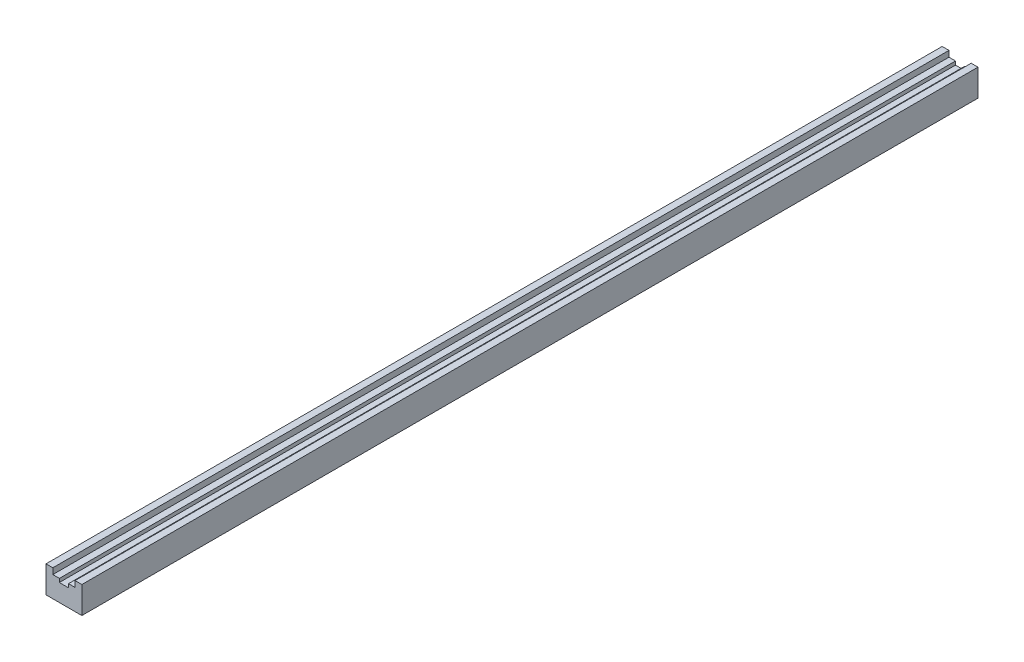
ISO-10303-21;
HEADER;
FILE_DESCRIPTION(('STEP AP214'),'2;1');
FILE_NAME('part.step','',(''),(''),'','','');
FILE_SCHEMA(('AUTOMOTIVE_DESIGN { 1 0 10303 214 1 1 1 1 }'));
ENDSEC;
DATA;
#1=APPLICATION_CONTEXT('core data for automotive mechanical design processes');
#2=APPLICATION_PROTOCOL_DEFINITION('international standard','automotive_design',2000,#1);
#3=PRODUCT_CONTEXT('',#1,'mechanical');
#4=PRODUCT('Part','Part','',(#3));
#5=PRODUCT_RELATED_PRODUCT_CATEGORY('part','',(#4));
#6=PRODUCT_DEFINITION_FORMATION('','',#4);
#7=PRODUCT_DEFINITION_CONTEXT('part definition',#1,'design');
#8=PRODUCT_DEFINITION('design','',#6,#7);
#9=PRODUCT_DEFINITION_SHAPE('','',#8);
#10=(LENGTH_UNIT() NAMED_UNIT(*) SI_UNIT(.MILLI.,.METRE.));
#11=(NAMED_UNIT(*) PLANE_ANGLE_UNIT() SI_UNIT($,.RADIAN.));
#12=(NAMED_UNIT(*) SI_UNIT($,.STERADIAN.) SOLID_ANGLE_UNIT());
#13=UNCERTAINTY_MEASURE_WITH_UNIT(LENGTH_MEASURE(1.E-05),#10,'distance_accuracy_value','');
#14=(GEOMETRIC_REPRESENTATION_CONTEXT(3) GLOBAL_UNCERTAINTY_ASSIGNED_CONTEXT((#13)) GLOBAL_UNIT_ASSIGNED_CONTEXT((#10,
#11,#12)) REPRESENTATION_CONTEXT('',''));
#15=CARTESIAN_POINT('',(0.,0.,0.));
#16=DIRECTION('',(0.,0.,1.));
#17=DIRECTION('',(1.,0.,0.));
#18=AXIS2_PLACEMENT_3D('',#15,#16,#17);
#19=CARTESIAN_POINT('',(-10.,15.,0.));
#20=DIRECTION('',(-1.,0.,0.));
#21=DIRECTION('',(0.,0.,1.));
#22=AXIS2_PLACEMENT_3D('',#19,#20,#21);
#23=PLANE('',#22);
#24=DIRECTION('',(0.,0.,1.));
#25=VECTOR('',#24,1.);
#26=CARTESIAN_POINT('',(-10.,15.,0.));
#27=LINE('',#26,#25);
#28=CARTESIAN_POINT('',(-10.,15.,0.));
#29=VERTEX_POINT('',#28);
#30=CARTESIAN_POINT('',(-10.,15.,500.));
#31=VERTEX_POINT('',#30);
#32=EDGE_CURVE('E9',#29,#31,#27,.T.);
#33=ORIENTED_EDGE('',*,*,#32,.F.);
#34=DIRECTION('',(0.,-1.,0.));
#35=VECTOR('',#34,1.);
#36=CARTESIAN_POINT('',(-10.,15.,0.));
#37=LINE('',#36,#35);
#38=CARTESIAN_POINT('',(-10.,0.,0.));
#39=VERTEX_POINT('',#38);
#40=EDGE_CURVE('E103',#29,#39,#37,.T.);
#41=ORIENTED_EDGE('',*,*,#40,.T.);
#42=DIRECTION('',(0.,0.,1.));
#43=VECTOR('',#42,1.);
#44=CARTESIAN_POINT('',(-10.,0.,0.));
#45=LINE('',#44,#43);
#46=CARTESIAN_POINT('',(-10.,0.,500.));
#47=VERTEX_POINT('',#46);
#48=EDGE_CURVE('E99',#39,#47,#45,.T.);
#49=ORIENTED_EDGE('',*,*,#48,.T.);
#50=DIRECTION('',(0.,-1.,0.));
#51=VECTOR('',#50,1.);
#52=CARTESIAN_POINT('',(-10.,15.,500.));
#53=LINE('',#52,#51);
#54=EDGE_CURVE('E101',#31,#47,#53,.T.);
#55=ORIENTED_EDGE('',*,*,#54,.F.);
#56=EDGE_LOOP('',(#33,#41,#49,#55));
#57=FACE_BOUND('',#56,.T.);
#58=ADVANCED_FACE('F14',(#57),#23,.T.);
#59=CARTESIAN_POINT('',(-10.,15.,0.));
#60=DIRECTION('',(0.,-1.,0.));
#61=DIRECTION('',(0.,0.,-1.));
#62=AXIS2_PLACEMENT_3D('',#59,#60,#61);
#63=PLANE('',#62);
#64=DIRECTION('',(0.,0.,1.));
#65=VECTOR('',#64,1.);
#66=CARTESIAN_POINT('',(-6.2,15.,0.));
#67=LINE('',#66,#65);
#68=CARTESIAN_POINT('',(-6.2,15.,0.));
#69=VERTEX_POINT('',#68);
#70=CARTESIAN_POINT('',(-6.2,15.,500.));
#71=VERTEX_POINT('',#70);
#72=EDGE_CURVE('E22',#69,#71,#67,.T.);
#73=ORIENTED_EDGE('',*,*,#72,.F.);
#74=DIRECTION('',(1.,0.,0.));
#75=VECTOR('',#74,1.);
#76=CARTESIAN_POINT('',(-10.,15.,0.));
#77=LINE('',#76,#75);
#78=EDGE_CURVE('E109',#29,#69,#77,.T.);
#79=ORIENTED_EDGE('',*,*,#78,.F.);
#80=ORIENTED_EDGE('',*,*,#32,.T.);
#81=DIRECTION('',(1.,0.,0.));
#82=VECTOR('',#81,1.);
#83=CARTESIAN_POINT('',(-10.,15.,500.));
#84=LINE('',#83,#82);
#85=EDGE_CURVE('E118',#31,#71,#84,.T.);
#86=ORIENTED_EDGE('',*,*,#85,.T.);
#87=EDGE_LOOP('',(#73,#79,#80,#86));
#88=FACE_BOUND('',#87,.T.);
#89=ADVANCED_FACE('F16',(#88),#63,.F.);
#90=CARTESIAN_POINT('',(-6.2,15.,0.));
#91=DIRECTION('',(-1.,0.,0.));
#92=DIRECTION('',(0.,0.,1.));
#93=AXIS2_PLACEMENT_3D('',#90,#91,#92);
#94=PLANE('',#93);
#95=DIRECTION('',(0.,0.,1.));
#96=VECTOR('',#95,1.);
#97=CARTESIAN_POINT('',(-6.2,11.7,0.));
#98=LINE('',#97,#96);
#99=CARTESIAN_POINT('',(-6.2,11.7,0.));
#100=VERTEX_POINT('',#99);
#101=CARTESIAN_POINT('',(-6.2,11.7,500.));
#102=VERTEX_POINT('',#101);
#103=EDGE_CURVE('E197',#100,#102,#98,.T.);
#104=ORIENTED_EDGE('',*,*,#103,.F.);
#105=DIRECTION('',(0.,-1.,0.));
#106=VECTOR('',#105,1.);
#107=CARTESIAN_POINT('',(-6.2,15.,0.));
#108=LINE('',#107,#106);
#109=EDGE_CURVE('E177',#69,#100,#108,.T.);
#110=ORIENTED_EDGE('',*,*,#109,.F.);
#111=ORIENTED_EDGE('',*,*,#72,.T.);
#112=DIRECTION('',(0.,-1.,0.));
#113=VECTOR('',#112,1.);
#114=CARTESIAN_POINT('',(-6.2,15.,500.));
#115=LINE('',#114,#113);
#116=EDGE_CURVE('E146',#71,#102,#115,.T.);
#117=ORIENTED_EDGE('',*,*,#116,.T.);
#118=EDGE_LOOP('',(#104,#110,#111,#117));
#119=FACE_BOUND('',#118,.T.);
#120=ADVANCED_FACE('F199',(#119),#94,.F.);
#121=CARTESIAN_POINT('',(-6.2,11.7,0.));
#122=DIRECTION('',(0.,-1.,0.));
#123=DIRECTION('',(1.,0.,0.));
#124=AXIS2_PLACEMENT_3D('',#121,#122,#123);
#125=PLANE('',#124);
#126=DIRECTION('',(0.,0.,1.));
#127=VECTOR('',#126,1.);
#128=CARTESIAN_POINT('',(-2.54999999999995,11.7,0.));
#129=LINE('',#128,#127);
#130=CARTESIAN_POINT('',(-2.54999999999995,11.7,0.));
#131=VERTEX_POINT('',#130);
#132=CARTESIAN_POINT('',(-2.54999999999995,11.7,500.));
#133=VERTEX_POINT('',#132);
#134=EDGE_CURVE('E195',#131,#133,#129,.T.);
#135=ORIENTED_EDGE('',*,*,#134,.F.);
#136=DIRECTION('',(1.,0.,0.));
#137=VECTOR('',#136,1.);
#138=CARTESIAN_POINT('',(-6.2,11.7,0.));
#139=LINE('',#138,#137);
#140=EDGE_CURVE('E174',#100,#131,#139,.T.);
#141=ORIENTED_EDGE('',*,*,#140,.F.);
#142=ORIENTED_EDGE('',*,*,#103,.T.);
#143=DIRECTION('',(1.,0.,0.));
#144=VECTOR('',#143,1.);
#145=CARTESIAN_POINT('',(-6.2,11.7,500.));
#146=LINE('',#145,#144);
#147=EDGE_CURVE('E143',#102,#133,#146,.T.);
#148=ORIENTED_EDGE('',*,*,#147,.T.);
#149=EDGE_LOOP('',(#135,#141,#142,#148));
#150=FACE_BOUND('',#149,.T.);
#151=ADVANCED_FACE('F231',(#150),#125,.F.);
#152=CARTESIAN_POINT('',(-2.54999999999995,11.7,0.));
#153=DIRECTION('',(-1.,0.,0.));
#154=DIRECTION('',(0.,0.,1.));
#155=AXIS2_PLACEMENT_3D('',#152,#153,#154);
#156=PLANE('',#155);
#157=DIRECTION('',(0.,0.,1.));
#158=VECTOR('',#157,1.);
#159=CARTESIAN_POINT('',(-2.54999999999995,9.69999999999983,0.));
#160=LINE('',#159,#158);
#161=CARTESIAN_POINT('',(-2.54999999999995,9.69999999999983,0.));
#162=VERTEX_POINT('',#161);
#163=CARTESIAN_POINT('',(-2.54999999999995,9.69999999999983,500.));
#164=VERTEX_POINT('',#163);
#165=EDGE_CURVE('E193',#162,#164,#160,.T.);
#166=ORIENTED_EDGE('',*,*,#165,.F.);
#167=DIRECTION('',(0.,-1.,0.));
#168=VECTOR('',#167,1.);
#169=CARTESIAN_POINT('',(-2.54999999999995,11.7,0.));
#170=LINE('',#169,#168);
#171=EDGE_CURVE('E171',#131,#162,#170,.T.);
#172=ORIENTED_EDGE('',*,*,#171,.F.);
#173=ORIENTED_EDGE('',*,*,#134,.T.);
#174=DIRECTION('',(0.,-1.,0.));
#175=VECTOR('',#174,1.);
#176=CARTESIAN_POINT('',(-2.54999999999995,11.7,500.));
#177=LINE('',#176,#175);
#178=EDGE_CURVE('E140',#133,#164,#177,.T.);
#179=ORIENTED_EDGE('',*,*,#178,.T.);
#180=EDGE_LOOP('',(#166,#172,#173,#179));
#181=FACE_BOUND('',#180,.T.);
#182=ADVANCED_FACE('F229',(#181),#156,.F.);
#183=CARTESIAN_POINT('',(-2.54999999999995,9.69999999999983,0.));
#184=DIRECTION('',(0.,-1.,0.));
#185=DIRECTION('',(1.,0.,0.));
#186=AXIS2_PLACEMENT_3D('',#183,#184,#185);
#187=PLANE('',#186);
#188=DIRECTION('',(0.,0.,1.));
#189=VECTOR('',#188,1.);
#190=CARTESIAN_POINT('',(2.54999999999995,9.7,0.));
#191=LINE('',#190,#189);
#192=CARTESIAN_POINT('',(2.54999999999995,9.7,0.));
#193=VERTEX_POINT('',#192);
#194=CARTESIAN_POINT('',(2.54999999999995,9.7,500.));
#195=VERTEX_POINT('',#194);
#196=EDGE_CURVE('E191',#193,#195,#191,.T.);
#197=ORIENTED_EDGE('',*,*,#196,.F.);
#198=DIRECTION('',(1.,0.,0.));
#199=VECTOR('',#198,1.);
#200=CARTESIAN_POINT('',(-2.54999999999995,9.69999999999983,0.));
#201=LINE('',#200,#199);
#202=EDGE_CURVE('E168',#162,#193,#201,.T.);
#203=ORIENTED_EDGE('',*,*,#202,.F.);
#204=ORIENTED_EDGE('',*,*,#165,.T.);
#205=DIRECTION('',(1.,0.,0.));
#206=VECTOR('',#205,1.);
#207=CARTESIAN_POINT('',(-2.54999999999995,9.69999999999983,500.));
#208=LINE('',#207,#206);
#209=EDGE_CURVE('E137',#164,#195,#208,.T.);
#210=ORIENTED_EDGE('',*,*,#209,.T.);
#211=EDGE_LOOP('',(#197,#203,#204,#210));
#212=FACE_BOUND('',#211,.T.);
#213=ADVANCED_FACE('F225',(#212),#187,.F.);
#214=CARTESIAN_POINT('',(2.54999999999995,11.7,0.));
#215=DIRECTION('',(-1.,0.,0.));
#216=DIRECTION('',(0.,0.,1.));
#217=AXIS2_PLACEMENT_3D('',#214,#215,#216);
#218=PLANE('',#217);
#219=DIRECTION('',(0.,0.,1.));
#220=VECTOR('',#219,1.);
#221=CARTESIAN_POINT('',(2.54999999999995,11.7,0.));
#222=LINE('',#221,#220);
#223=CARTESIAN_POINT('',(2.54999999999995,11.7,0.));
#224=VERTEX_POINT('',#223);
#225=CARTESIAN_POINT('',(2.54999999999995,11.7,500.));
#226=VERTEX_POINT('',#225);
#227=EDGE_CURVE('E189',#224,#226,#222,.T.);
#228=ORIENTED_EDGE('',*,*,#227,.F.);
#229=DIRECTION('',(0.,-1.,0.));
#230=VECTOR('',#229,1.);
#231=CARTESIAN_POINT('',(2.54999999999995,11.7,0.));
#232=LINE('',#231,#230);
#233=EDGE_CURVE('E165',#224,#193,#232,.T.);
#234=ORIENTED_EDGE('',*,*,#233,.T.);
#235=ORIENTED_EDGE('',*,*,#196,.T.);
#236=DIRECTION('',(0.,-1.,0.));
#237=VECTOR('',#236,1.);
#238=CARTESIAN_POINT('',(2.54999999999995,11.7,500.));
#239=LINE('',#238,#237);
#240=EDGE_CURVE('E134',#226,#195,#239,.T.);
#241=ORIENTED_EDGE('',*,*,#240,.F.);
#242=EDGE_LOOP('',(#228,#234,#235,#241));
#243=FACE_BOUND('',#242,.T.);
#244=ADVANCED_FACE('F222',(#243),#218,.T.);
#245=CARTESIAN_POINT('',(2.54999999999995,11.7,0.));
#246=DIRECTION('',(0.,-1.,0.));
#247=DIRECTION('',(0.,0.,-1.));
#248=AXIS2_PLACEMENT_3D('',#245,#246,#247);
#249=PLANE('',#248);
#250=DIRECTION('',(0.,0.,1.));
#251=VECTOR('',#250,1.);
#252=CARTESIAN_POINT('',(6.20000000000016,11.7,0.));
#253=LINE('',#252,#251);
#254=CARTESIAN_POINT('',(6.20000000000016,11.7,0.));
#255=VERTEX_POINT('',#254);
#256=CARTESIAN_POINT('',(6.20000000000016,11.7,500.));
#257=VERTEX_POINT('',#256);
#258=EDGE_CURVE('E187',#255,#257,#253,.T.);
#259=ORIENTED_EDGE('',*,*,#258,.F.);
#260=DIRECTION('',(1.,0.,0.));
#261=VECTOR('',#260,1.);
#262=CARTESIAN_POINT('',(2.54999999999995,11.7,0.));
#263=LINE('',#262,#261);
#264=EDGE_CURVE('E162',#224,#255,#263,.T.);
#265=ORIENTED_EDGE('',*,*,#264,.F.);
#266=ORIENTED_EDGE('',*,*,#227,.T.);
#267=DIRECTION('',(1.,0.,0.));
#268=VECTOR('',#267,1.);
#269=CARTESIAN_POINT('',(2.54999999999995,11.7,500.));
#270=LINE('',#269,#268);
#271=EDGE_CURVE('E131',#226,#257,#270,.T.);
#272=ORIENTED_EDGE('',*,*,#271,.T.);
#273=EDGE_LOOP('',(#259,#265,#266,#272));
#274=FACE_BOUND('',#273,.T.);
#275=ADVANCED_FACE('F218',(#274),#249,.F.);
#276=CARTESIAN_POINT('',(6.2,15.,0.));
#277=DIRECTION('',(-1.,0.,0.));
#278=DIRECTION('',(0.,-1.,0.));
#279=AXIS2_PLACEMENT_3D('',#276,#277,#278);
#280=PLANE('',#279);
#281=DIRECTION('',(0.,0.,1.));
#282=VECTOR('',#281,1.);
#283=CARTESIAN_POINT('',(6.2,15.,0.));
#284=LINE('',#283,#282);
#285=CARTESIAN_POINT('',(6.2,15.,0.));
#286=VERTEX_POINT('',#285);
#287=CARTESIAN_POINT('',(6.2,15.,500.));
#288=VERTEX_POINT('',#287);
#289=EDGE_CURVE('E185',#286,#288,#284,.T.);
#290=ORIENTED_EDGE('',*,*,#289,.F.);
#291=DIRECTION('',(0.,-1.,0.));
#292=VECTOR('',#291,1.);
#293=CARTESIAN_POINT('',(6.2,15.,0.));
#294=LINE('',#293,#292);
#295=EDGE_CURVE('E159',#286,#255,#294,.T.);
#296=ORIENTED_EDGE('',*,*,#295,.T.);
#297=ORIENTED_EDGE('',*,*,#258,.T.);
#298=DIRECTION('',(0.,-1.,0.));
#299=VECTOR('',#298,1.);
#300=CARTESIAN_POINT('',(6.2,15.,500.));
#301=LINE('',#300,#299);
#302=EDGE_CURVE('E128',#288,#257,#301,.T.);
#303=ORIENTED_EDGE('',*,*,#302,.F.);
#304=EDGE_LOOP('',(#290,#296,#297,#303));
#305=FACE_BOUND('',#304,.T.);
#306=ADVANCED_FACE('F214',(#305),#280,.T.);
#307=CARTESIAN_POINT('',(6.2,15.,0.));
#308=DIRECTION('',(0.,-1.,0.));
#309=DIRECTION('',(1.,0.,0.));
#310=AXIS2_PLACEMENT_3D('',#307,#308,#309);
#311=PLANE('',#310);
#312=DIRECTION('',(0.,0.,1.));
#313=VECTOR('',#312,1.);
#314=CARTESIAN_POINT('',(10.,15.,0.));
#315=LINE('',#314,#313);
#316=CARTESIAN_POINT('',(10.,15.,0.));
#317=VERTEX_POINT('',#316);
#318=CARTESIAN_POINT('',(10.,15.,500.));
#319=VERTEX_POINT('',#318);
#320=EDGE_CURVE('E183',#317,#319,#315,.T.);
#321=ORIENTED_EDGE('',*,*,#320,.F.);
#322=DIRECTION('',(1.,0.,0.));
#323=VECTOR('',#322,1.);
#324=CARTESIAN_POINT('',(6.2,15.,0.));
#325=LINE('',#324,#323);
#326=EDGE_CURVE('E156',#286,#317,#325,.T.);
#327=ORIENTED_EDGE('',*,*,#326,.F.);
#328=ORIENTED_EDGE('',*,*,#289,.T.);
#329=DIRECTION('',(1.,0.,0.));
#330=VECTOR('',#329,1.);
#331=CARTESIAN_POINT('',(6.2,15.,500.));
#332=LINE('',#331,#330);
#333=EDGE_CURVE('E123',#288,#319,#332,.T.);
#334=ORIENTED_EDGE('',*,*,#333,.T.);
#335=EDGE_LOOP('',(#321,#327,#328,#334));
#336=FACE_BOUND('',#335,.T.);
#337=ADVANCED_FACE('F212',(#336),#311,.F.);
#338=CARTESIAN_POINT('',(10.,15.,0.));
#339=DIRECTION('',(-1.,0.,0.));
#340=DIRECTION('',(0.,0.,1.));
#341=AXIS2_PLACEMENT_3D('',#338,#339,#340);
#342=PLANE('',#341);
#343=DIRECTION('',(0.,0.,1.));
#344=VECTOR('',#343,1.);
#345=CARTESIAN_POINT('',(10.,0.,0.));
#346=LINE('',#345,#344);
#347=CARTESIAN_POINT('',(10.,0.,0.));
#348=VERTEX_POINT('',#347);
#349=CARTESIAN_POINT('',(10.,0.,500.));
#350=VERTEX_POINT('',#349);
#351=EDGE_CURVE('E108',#348,#350,#346,.T.);
#352=ORIENTED_EDGE('',*,*,#351,.F.);
#353=DIRECTION('',(0.,-1.,0.));
#354=VECTOR('',#353,1.);
#355=CARTESIAN_POINT('',(10.,15.,0.));
#356=LINE('',#355,#354);
#357=EDGE_CURVE('E153',#317,#348,#356,.T.);
#358=ORIENTED_EDGE('',*,*,#357,.F.);
#359=ORIENTED_EDGE('',*,*,#320,.T.);
#360=DIRECTION('',(0.,-1.,0.));
#361=VECTOR('',#360,1.);
#362=CARTESIAN_POINT('',(10.,15.,500.));
#363=LINE('',#362,#361);
#364=EDGE_CURVE('E121',#319,#350,#363,.T.);
#365=ORIENTED_EDGE('',*,*,#364,.T.);
#366=EDGE_LOOP('',(#352,#358,#359,#365));
#367=FACE_BOUND('',#366,.T.);
#368=ADVANCED_FACE('F208',(#367),#342,.F.);
#369=CARTESIAN_POINT('',(-10.,0.,0.));
#370=DIRECTION('',(0.,-1.,0.));
#371=DIRECTION('',(1.,0.,0.));
#372=AXIS2_PLACEMENT_3D('',#369,#370,#371);
#373=PLANE('',#372);
#374=DIRECTION('',(1.,0.,0.));
#375=VECTOR('',#374,1.);
#376=CARTESIAN_POINT('',(-10.,0.,0.));
#377=LINE('',#376,#375);
#378=EDGE_CURVE('E151',#39,#348,#377,.T.);
#379=ORIENTED_EDGE('',*,*,#378,.T.);
#380=ORIENTED_EDGE('',*,*,#351,.T.);
#381=DIRECTION('',(1.,0.,0.));
#382=VECTOR('',#381,1.);
#383=CARTESIAN_POINT('',(-10.,0.,500.));
#384=LINE('',#383,#382);
#385=EDGE_CURVE('E115',#47,#350,#384,.T.);
#386=ORIENTED_EDGE('',*,*,#385,.F.);
#387=ORIENTED_EDGE('',*,*,#48,.F.);
#388=EDGE_LOOP('',(#379,#380,#386,#387));
#389=FACE_BOUND('',#388,.T.);
#390=ADVANCED_FACE('F120',(#389),#373,.T.);
#391=CARTESIAN_POINT('',(-10.,11.7,0.));
#392=DIRECTION('',(0.,0.,1.));
#393=DIRECTION('',(1.,0.,0.));
#394=AXIS2_PLACEMENT_3D('',#391,#392,#393);
#395=PLANE('',#394);
#396=ORIENTED_EDGE('',*,*,#40,.F.);
#397=ORIENTED_EDGE('',*,*,#78,.T.);
#398=ORIENTED_EDGE('',*,*,#109,.T.);
#399=ORIENTED_EDGE('',*,*,#140,.T.);
#400=ORIENTED_EDGE('',*,*,#171,.T.);
#401=ORIENTED_EDGE('',*,*,#202,.T.);
#402=ORIENTED_EDGE('',*,*,#233,.F.);
#403=ORIENTED_EDGE('',*,*,#264,.T.);
#404=ORIENTED_EDGE('',*,*,#295,.F.);
#405=ORIENTED_EDGE('',*,*,#326,.T.);
#406=ORIENTED_EDGE('',*,*,#357,.T.);
#407=ORIENTED_EDGE('',*,*,#378,.F.);
#408=EDGE_LOOP('',(#396,#397,#398,#399,#400,#401,#402,#403,#404,#405,#406,#407));
#409=FACE_BOUND('',#408,.T.);
#410=ADVANCED_FACE('F203',(#409),#395,.F.);
#411=CARTESIAN_POINT('',(-10.,11.7,500.));
#412=DIRECTION('',(0.,0.,1.));
#413=DIRECTION('',(1.,0.,0.));
#414=AXIS2_PLACEMENT_3D('',#411,#412,#413);
#415=PLANE('',#414);
#416=ORIENTED_EDGE('',*,*,#54,.T.);
#417=ORIENTED_EDGE('',*,*,#385,.T.);
#418=ORIENTED_EDGE('',*,*,#364,.F.);
#419=ORIENTED_EDGE('',*,*,#333,.F.);
#420=ORIENTED_EDGE('',*,*,#302,.T.);
#421=ORIENTED_EDGE('',*,*,#271,.F.);
#422=ORIENTED_EDGE('',*,*,#240,.T.);
#423=ORIENTED_EDGE('',*,*,#209,.F.);
#424=ORIENTED_EDGE('',*,*,#178,.F.);
#425=ORIENTED_EDGE('',*,*,#147,.F.);
#426=ORIENTED_EDGE('',*,*,#116,.F.);
#427=ORIENTED_EDGE('',*,*,#85,.F.);
#428=EDGE_LOOP('',(#416,#417,#418,#419,#420,#421,#422,#423,#424,#425,#426,#427));
#429=FACE_BOUND('',#428,.T.);
#430=ADVANCED_FACE('F113',(#429),#415,.T.);
#431=CLOSED_SHELL('',(#58,#89,#120,#151,#182,#213,#244,#275,#306,#337,#368,#390,#410,#430));
#432=MANIFOLD_SOLID_BREP('B1',#431);
#433=ADVANCED_BREP_SHAPE_REPRESENTATION('',(#18,#432),#14);
#434=SHAPE_DEFINITION_REPRESENTATION(#9,#433);
ENDSEC;
END-ISO-10303-21;
